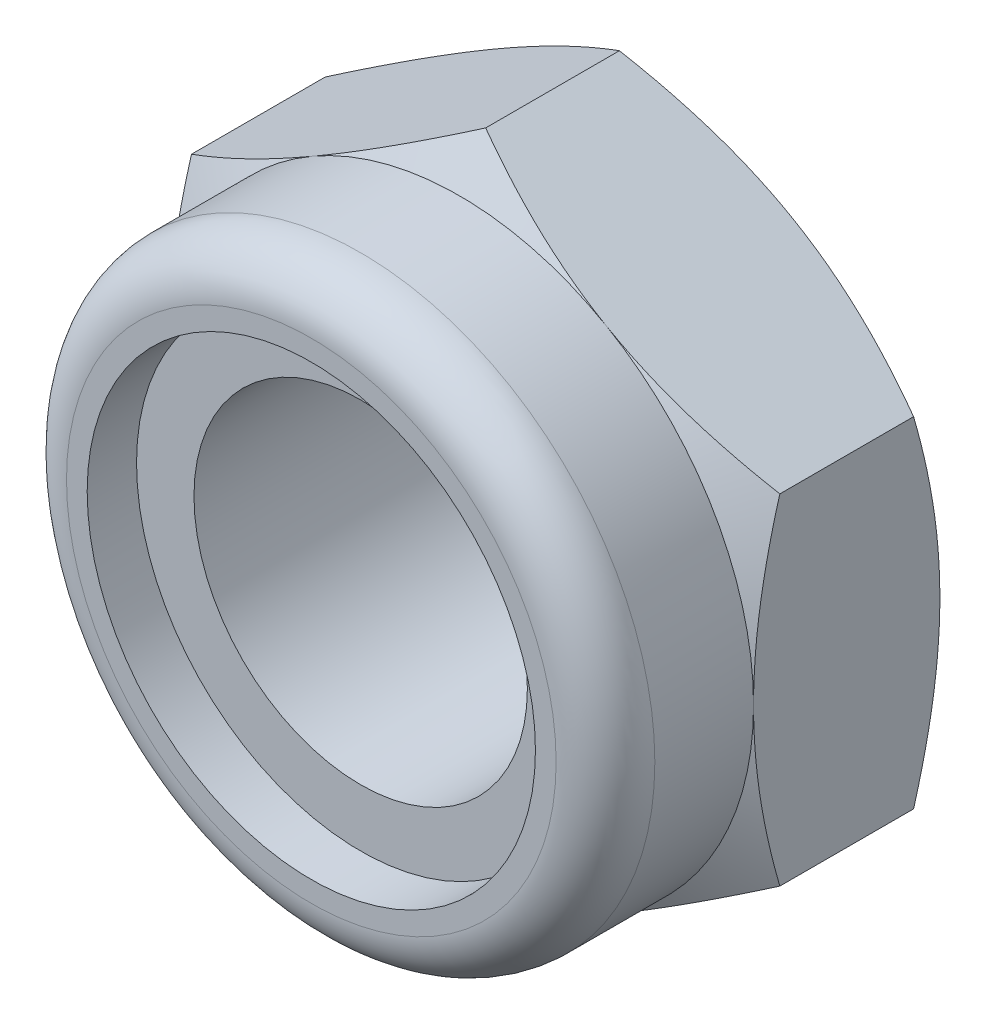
ISO-10303-21;
HEADER;
FILE_DESCRIPTION(('STEP AP214'),'2;1');
FILE_NAME('part.step','',(''),(''),'','','');
FILE_SCHEMA(('AUTOMOTIVE_DESIGN { 1 0 10303 214 1 1 1 1 }'));
ENDSEC;
DATA;
#1=APPLICATION_CONTEXT('core data for automotive mechanical design processes');
#2=APPLICATION_PROTOCOL_DEFINITION('international standard','automotive_design',2000,#1);
#3=PRODUCT_CONTEXT('',#1,'mechanical');
#4=PRODUCT('Part','Part','',(#3));
#5=PRODUCT_RELATED_PRODUCT_CATEGORY('part','',(#4));
#6=PRODUCT_DEFINITION_FORMATION('','',#4);
#7=PRODUCT_DEFINITION_CONTEXT('part definition',#1,'design');
#8=PRODUCT_DEFINITION('design','',#6,#7);
#9=PRODUCT_DEFINITION_SHAPE('','',#8);
#10=(LENGTH_UNIT() NAMED_UNIT(*) SI_UNIT(.MILLI.,.METRE.));
#11=(NAMED_UNIT(*) PLANE_ANGLE_UNIT() SI_UNIT($,.RADIAN.));
#12=(NAMED_UNIT(*) SI_UNIT($,.STERADIAN.) SOLID_ANGLE_UNIT());
#13=UNCERTAINTY_MEASURE_WITH_UNIT(LENGTH_MEASURE(1.E-05),#10,'distance_accuracy_value','');
#14=(GEOMETRIC_REPRESENTATION_CONTEXT(3) GLOBAL_UNCERTAINTY_ASSIGNED_CONTEXT((#13)) GLOBAL_UNIT_ASSIGNED_CONTEXT((#10,
#11,#12)) REPRESENTATION_CONTEXT('',''));
#15=CARTESIAN_POINT('',(0.,0.,0.));
#16=DIRECTION('',(0.,0.,1.));
#17=DIRECTION('',(1.,0.,0.));
#18=AXIS2_PLACEMENT_3D('',#15,#16,#17);
#19=CARTESIAN_POINT('',(0.,0.,-5.7));
#20=DIRECTION('',(0.,0.,1.));
#21=DIRECTION('',(1.,0.,0.));
#22=AXIS2_PLACEMENT_3D('',#19,#20,#21);
#23=CYLINDRICAL_SURFACE('',#22,5.1);
#24=CARTESIAN_POINT('',(0.,0.,3.02));
#25=DIRECTION('',(0.,0.,1.));
#26=DIRECTION('',(1.,0.,0.));
#27=AXIS2_PLACEMENT_3D('',#24,#25,#26);
#28=CIRCLE('',#27,5.1);
#29=CARTESIAN_POINT('',(5.1,0.,3.02));
#30=VERTEX_POINT('',#29);
#31=EDGE_CURVE('E281',#30,#30,#28,.T.);
#32=ORIENTED_EDGE('',*,*,#31,.T.);
#33=EDGE_LOOP('',(#32));
#34=FACE_BOUND('',#33,.T.);
#35=CARTESIAN_POINT('',(0.,0.,-5.04441321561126));
#36=DIRECTION('',(0.,0.,-1.));
#37=DIRECTION('',(-1.,0.,0.));
#38=AXIS2_PLACEMENT_3D('',#35,#36,#37);
#39=CIRCLE('',#38,5.1);
#40=CARTESIAN_POINT('',(-5.1,0.,-5.04441321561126));
#41=VERTEX_POINT('',#40);
#42=EDGE_CURVE('E40',#41,#41,#39,.F.);
#43=ORIENTED_EDGE('',*,*,#42,.F.);
#44=EDGE_LOOP('',(#43));
#45=FACE_BOUND('',#44,.T.);
#46=ADVANCED_FACE('F35',(#34,#45),#23,.F.);
#47=CARTESIAN_POINT('',(0.,10.3923048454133,-5.7));
#48=DIRECTION('',(-0.500000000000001,0.866025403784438,0.));
#49=DIRECTION('',(-0.866025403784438,-0.500000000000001,0.));
#50=AXIS2_PLACEMENT_3D('',#47,#48,#49);
#51=PLANE('',#50);
#52=DIRECTION('',(0.,0.,1.));
#53=VECTOR('',#52,1.);
#54=CARTESIAN_POINT('',(-9.,5.19615242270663,-5.7));
#55=LINE('',#54,#53);
#56=CARTESIAN_POINT('',(-9.,5.19615242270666,-4.89615242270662));
#57=VERTEX_POINT('',#56);
#58=CARTESIAN_POINT('',(-9.,5.19615242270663,-0.803847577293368));
#59=VERTEX_POINT('',#58);
#60=EDGE_CURVE('E254',#57,#59,#55,.T.);
#61=ORIENTED_EDGE('',*,*,#60,.T.);
#62=CARTESIAN_POINT('',(-9.0002,5.19603695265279,-0.803914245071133));
#63=CARTESIAN_POINT('',(-8.80239295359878,5.31024090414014,-0.737982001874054));
#64=CARTESIAN_POINT('',(-8.60381439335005,5.42489028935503,-0.675041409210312));
#65=CARTESIAN_POINT('',(-8.20504463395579,5.65512011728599,-0.555968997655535));
#66=CARTESIAN_POINT('',(-8.00485277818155,5.77070093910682,-0.499840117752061));
#67=CARTESIAN_POINT('',(-7.6024849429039,6.00300811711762,-0.395151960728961));
#68=CARTESIAN_POINT('',(-7.4003054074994,6.11973652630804,-0.346610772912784));
#69=CARTESIAN_POINT('',(-6.99457124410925,6.35398725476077,-0.258148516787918));
#70=CARTESIAN_POINT('',(-6.79101690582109,6.47150940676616,-0.218225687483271));
#71=CARTESIAN_POINT('',(-6.38769409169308,6.70436794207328,-0.148684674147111));
#72=CARTESIAN_POINT('',(-6.187955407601,6.81968712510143,-0.118837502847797));
#73=CARTESIAN_POINT('',(-5.787584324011,7.05084147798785,-0.0687933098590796));
#74=CARTESIAN_POINT('',(-5.58695200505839,7.16667660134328,-0.0485954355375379));
#75=CARTESIAN_POINT('',(-5.18533936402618,7.39854776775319,-0.0183543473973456));
#76=CARTESIAN_POINT('',(-4.98435969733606,7.51458343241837,-0.00829960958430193));
#77=CARTESIAN_POINT('',(-4.58221540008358,7.74676155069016,0.00143766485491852));
#78=CARTESIAN_POINT('',(-4.38105077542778,7.86290400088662,0.00112052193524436));
#79=CARTESIAN_POINT('',(-4.0049673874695,8.08003584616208,-0.00916395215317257));
#80=CARTESIAN_POINT('',(-3.83002210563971,8.18104055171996,-0.0178767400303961));
#81=CARTESIAN_POINT('',(-3.48054132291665,8.38281337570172,-0.0429773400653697));
#82=CARTESIAN_POINT('',(-3.30600585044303,8.48358147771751,-0.0593656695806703));
#83=CARTESIAN_POINT('',(-2.78307512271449,8.7854956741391,-0.119656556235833));
#84=CARTESIAN_POINT('',(-2.43560548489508,8.98610736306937,-0.174677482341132));
#85=CARTESIAN_POINT('',(-1.736980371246,9.3894587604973,-0.312230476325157));
#86=CARTESIAN_POINT('',(-1.38591405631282,9.59214699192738,-0.395345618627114));
#87=CARTESIAN_POINT('',(-0.689016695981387,9.99450087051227,-0.583982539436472));
#88=CARTESIAN_POINT('',(-0.343176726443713,10.1941716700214,-0.689460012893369));
#89=CARTESIAN_POINT('',(0.000200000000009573,10.3924203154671,-0.803914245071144));
#90=B_SPLINE_CURVE_WITH_KNOTS('',3,(#62,#63,#64,#65,#66,#67,#68,#69,#70,#71,#72,#73,#74,#75,#76,
#77,#78,#79,#80,#81,#82,#83,#84,#85,#86,#87,#88,#89),.UNSPECIFIED.,.F.,.F.,(4,2,2,2,2,2,2,2,2,2,
2,2,2,4),(0.,0.71321924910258,1.42674513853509,2.14194697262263,2.85700253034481,
3.55449749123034,4.25193080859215,4.94857085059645,5.64518936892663,6.25162976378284,
6.85811104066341,8.07193747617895,9.31268391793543,10.5509947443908),.UNSPECIFIED.);
#91=CARTESIAN_POINT('',(-4.50000000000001,7.79422863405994,0.));
#92=VERTEX_POINT('',#91);
#93=EDGE_CURVE('E60',#59,#92,#90,.T.);
#94=ORIENTED_EDGE('',*,*,#93,.T.);
#95=CARTESIAN_POINT('',(0.,10.3923048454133,-0.803847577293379));
#96=VERTEX_POINT('',#95);
#97=EDGE_CURVE('E203',#92,#96,#90,.T.);
#98=ORIENTED_EDGE('',*,*,#97,.T.);
#99=DIRECTION('',(0.,0.,1.));
#100=VECTOR('',#99,1.);
#101=CARTESIAN_POINT('',(0.,10.3923048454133,-5.7));
#102=LINE('',#101,#100);
#103=CARTESIAN_POINT('',(0.,10.3923048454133,-4.89615242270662));
#104=VERTEX_POINT('',#103);
#105=EDGE_CURVE('E240',#104,#96,#102,.T.);
#106=ORIENTED_EDGE('',*,*,#105,.F.);
#107=CARTESIAN_POINT('',(-9.0002,5.19603695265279,-4.89608575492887));
#108=CARTESIAN_POINT('',(-8.80239295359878,5.31024090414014,-4.96201799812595));
#109=CARTESIAN_POINT('',(-8.60381439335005,5.42489028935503,-5.02495859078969));
#110=CARTESIAN_POINT('',(-8.20504463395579,5.65512011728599,-5.14403100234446));
#111=CARTESIAN_POINT('',(-8.00485277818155,5.77070093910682,-5.20015988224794));
#112=CARTESIAN_POINT('',(-7.6024849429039,6.00300811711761,-5.30484803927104));
#113=CARTESIAN_POINT('',(-7.4003054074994,6.11973652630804,-5.35338922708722));
#114=CARTESIAN_POINT('',(-6.99457124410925,6.35398725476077,-5.44185148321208));
#115=CARTESIAN_POINT('',(-6.79101690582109,6.47150940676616,-5.48177431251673));
#116=CARTESIAN_POINT('',(-6.38769409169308,6.70436794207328,-5.55131532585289));
#117=CARTESIAN_POINT('',(-6.187955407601,6.81968712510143,-5.5811624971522));
#118=CARTESIAN_POINT('',(-5.787584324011,7.05084147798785,-5.63120669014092));
#119=CARTESIAN_POINT('',(-5.58695200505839,7.16667660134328,-5.65140456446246));
#120=CARTESIAN_POINT('',(-5.18533936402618,7.39854776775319,-5.68164565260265));
#121=CARTESIAN_POINT('',(-4.98435969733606,7.51458343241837,-5.6917003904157));
#122=CARTESIAN_POINT('',(-4.58221540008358,7.74676155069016,-5.70143766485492));
#123=CARTESIAN_POINT('',(-4.38105077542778,7.86290400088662,-5.70112052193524));
#124=CARTESIAN_POINT('',(-4.0049673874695,8.08003584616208,-5.69083604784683));
#125=CARTESIAN_POINT('',(-3.83002210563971,8.18104055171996,-5.6821232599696));
#126=CARTESIAN_POINT('',(-3.48054132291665,8.38281337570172,-5.65702265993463));
#127=CARTESIAN_POINT('',(-3.30600585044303,8.48358147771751,-5.64063433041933));
#128=CARTESIAN_POINT('',(-2.78307512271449,8.7854956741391,-5.58034344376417));
#129=CARTESIAN_POINT('',(-2.43560548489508,8.98610736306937,-5.52532251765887));
#130=CARTESIAN_POINT('',(-1.736980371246,9.3894587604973,-5.38776952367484));
#131=CARTESIAN_POINT('',(-1.38591405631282,9.59214699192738,-5.30465438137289));
#132=CARTESIAN_POINT('',(-0.689016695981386,9.99450087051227,-5.11601746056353));
#133=CARTESIAN_POINT('',(-0.343176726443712,10.1941716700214,-5.01053998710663));
#134=CARTESIAN_POINT('',(0.000200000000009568,10.3924203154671,-4.89608575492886));
#135=B_SPLINE_CURVE_WITH_KNOTS('',3,(#107,#108,#109,#110,#111,#112,#113,#114,#115,#116,#117,
#118,#119,#120,#121,#122,#123,#124,#125,#126,#127,#128,#129,#130,#131,#132,#133,#134),
.UNSPECIFIED.,.F.,.F.,(4,2,2,2,2,2,2,2,2,2,2,2,2,4),(0.,0.713219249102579,1.42674513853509,
2.14194697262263,2.85700253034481,3.55449749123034,4.25193080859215,4.94857085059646,
5.64518936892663,6.25162976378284,6.85811104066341,8.07193747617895,9.31268391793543,
10.5509947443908),.UNSPECIFIED.);
#136=CARTESIAN_POINT('',(-4.50000000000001,7.79422863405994,-5.7));
#137=VERTEX_POINT('',#136);
#138=EDGE_CURVE('E256',#137,#104,#135,.T.);
#139=ORIENTED_EDGE('',*,*,#138,.F.);
#140=EDGE_CURVE('E234',#57,#137,#135,.T.);
#141=ORIENTED_EDGE('',*,*,#140,.F.);
#142=EDGE_LOOP('',(#61,#94,#98,#106,#139,#141));
#143=FACE_BOUND('',#142,.T.);
#144=ADVANCED_FACE('F37',(#143),#51,.T.);
#145=CARTESIAN_POINT('',(9.,5.19615242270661,-5.7));
#146=DIRECTION('',(0.500000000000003,0.866025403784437,0.));
#147=DIRECTION('',(-0.866025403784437,0.500000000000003,0.));
#148=AXIS2_PLACEMENT_3D('',#145,#146,#147);
#149=PLANE('',#148);
#150=ORIENTED_EDGE('',*,*,#105,.T.);
#151=CARTESIAN_POINT('',(-0.000199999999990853,10.3924203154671,-0.803914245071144));
#152=CARTESIAN_POINT('',(0.197607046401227,10.2782163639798,-0.737982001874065));
#153=CARTESIAN_POINT('',(0.396185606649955,10.1635669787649,-0.675041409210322));
#154=CARTESIAN_POINT('',(0.79495536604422,9.93333715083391,-0.555968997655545));
#155=CARTESIAN_POINT('',(0.99514722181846,9.81775632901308,-0.49984011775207));
#156=CARTESIAN_POINT('',(1.39751505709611,9.58544915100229,-0.395151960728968));
#157=CARTESIAN_POINT('',(1.59969459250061,9.46872074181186,-0.34661077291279));
#158=CARTESIAN_POINT('',(2.00542875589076,9.23447001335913,-0.258148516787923));
#159=CARTESIAN_POINT('',(2.20898309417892,9.11694786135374,-0.218225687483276));
#160=CARTESIAN_POINT('',(2.61230590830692,8.88408932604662,-0.148684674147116));
#161=CARTESIAN_POINT('',(2.81204459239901,8.76877014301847,-0.118837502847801));
#162=CARTESIAN_POINT('',(3.212415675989,8.53761579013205,-0.0687933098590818));
#163=CARTESIAN_POINT('',(3.41304799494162,8.42178066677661,-0.0485954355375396));
#164=CARTESIAN_POINT('',(3.81466063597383,8.18990950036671,-0.0183543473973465));
#165=CARTESIAN_POINT('',(4.01564030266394,8.07387383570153,-0.00829960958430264));
#166=CARTESIAN_POINT('',(4.41778459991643,7.84169571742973,0.00143766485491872));
#167=CARTESIAN_POINT('',(4.61894922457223,7.72555326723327,0.00112052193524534));
#168=CARTESIAN_POINT('',(4.99503261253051,7.50842142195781,-0.00916395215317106));
#169=CARTESIAN_POINT('',(5.1699778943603,7.40741671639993,-0.0178767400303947));
#170=CARTESIAN_POINT('',(5.51945867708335,7.20564389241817,-0.0429773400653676));
#171=CARTESIAN_POINT('',(5.69399414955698,7.10487579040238,-0.0593656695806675));
#172=CARTESIAN_POINT('',(6.21692487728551,6.80296159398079,-0.119656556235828));
#173=CARTESIAN_POINT('',(6.56439451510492,6.60234990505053,-0.174677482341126));
#174=CARTESIAN_POINT('',(7.26301962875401,6.19899850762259,-0.312230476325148));
#175=CARTESIAN_POINT('',(7.61408594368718,5.99631027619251,-0.395345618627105));
#176=CARTESIAN_POINT('',(8.31098330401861,5.59395639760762,-0.583982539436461));
#177=CARTESIAN_POINT('',(8.65682327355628,5.39428559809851,-0.689460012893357));
#178=CARTESIAN_POINT('',(9.0002,5.19603695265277,-0.803914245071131));
#179=B_SPLINE_CURVE_WITH_KNOTS('',3,(#151,#152,#153,#154,#155,#156,#157,#158,#159,#160,#161,
#162,#163,#164,#165,#166,#167,#168,#169,#170,#171,#172,#173,#174,#175,#176,#177,#178),
.UNSPECIFIED.,.F.,.F.,(4,2,2,2,2,2,2,2,2,2,2,2,2,4),(0.,0.71321924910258,1.42674513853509,
2.14194697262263,2.85700253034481,3.55449749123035,4.25193080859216,4.94857085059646,
5.64518936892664,6.25162976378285,6.85811104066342,8.07193747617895,9.31268391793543,
10.5509947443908),.UNSPECIFIED.);
#180=CARTESIAN_POINT('',(4.50000000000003,7.79422863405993,0.));
#181=VERTEX_POINT('',#180);
#182=EDGE_CURVE('E212',#96,#181,#179,.T.);
#183=ORIENTED_EDGE('',*,*,#182,.T.);
#184=CARTESIAN_POINT('',(9.,5.19615242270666,-0.803847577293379));
#185=VERTEX_POINT('',#184);
#186=EDGE_CURVE('E204',#181,#185,#179,.T.);
#187=ORIENTED_EDGE('',*,*,#186,.T.);
#188=DIRECTION('',(0.,0.,1.));
#189=VECTOR('',#188,1.);
#190=CARTESIAN_POINT('',(9.,5.19615242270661,-5.7));
#191=LINE('',#190,#189);
#192=CARTESIAN_POINT('',(9.,5.19615242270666,-4.89615242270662));
#193=VERTEX_POINT('',#192);
#194=EDGE_CURVE('E244',#193,#185,#191,.T.);
#195=ORIENTED_EDGE('',*,*,#194,.F.);
#196=CARTESIAN_POINT('',(-0.000199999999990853,10.3924203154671,-4.89608575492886));
#197=CARTESIAN_POINT('',(0.197607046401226,10.2782163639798,-4.96201799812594));
#198=CARTESIAN_POINT('',(0.396185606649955,10.1635669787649,-5.02495859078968));
#199=CARTESIAN_POINT('',(0.79495536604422,9.93333715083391,-5.14403100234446));
#200=CARTESIAN_POINT('',(0.99514722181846,9.81775632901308,-5.20015988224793));
#201=CARTESIAN_POINT('',(1.39751505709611,9.58544915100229,-5.30484803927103));
#202=CARTESIAN_POINT('',(1.59969459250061,9.46872074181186,-5.35338922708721));
#203=CARTESIAN_POINT('',(2.00542875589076,9.23447001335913,-5.44185148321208));
#204=CARTESIAN_POINT('',(2.20898309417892,9.11694786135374,-5.48177431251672));
#205=CARTESIAN_POINT('',(2.61230590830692,8.88408932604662,-5.55131532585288));
#206=CARTESIAN_POINT('',(2.81204459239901,8.76877014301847,-5.5811624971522));
#207=CARTESIAN_POINT('',(3.212415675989,8.53761579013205,-5.63120669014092));
#208=CARTESIAN_POINT('',(3.41304799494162,8.42178066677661,-5.65140456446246));
#209=CARTESIAN_POINT('',(3.81466063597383,8.18990950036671,-5.68164565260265));
#210=CARTESIAN_POINT('',(4.01564030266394,8.07387383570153,-5.6917003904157));
#211=CARTESIAN_POINT('',(4.41778459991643,7.84169571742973,-5.70143766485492));
#212=CARTESIAN_POINT('',(4.61894922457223,7.72555326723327,-5.70112052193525));
#213=CARTESIAN_POINT('',(4.99503261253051,7.50842142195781,-5.69083604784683));
#214=CARTESIAN_POINT('',(5.1699778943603,7.40741671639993,-5.68212325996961));
#215=CARTESIAN_POINT('',(5.51945867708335,7.20564389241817,-5.65702265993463));
#216=CARTESIAN_POINT('',(5.69399414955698,7.10487579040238,-5.64063433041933));
#217=CARTESIAN_POINT('',(6.21692487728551,6.80296159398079,-5.58034344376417));
#218=CARTESIAN_POINT('',(6.56439451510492,6.60234990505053,-5.52532251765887));
#219=CARTESIAN_POINT('',(7.26301962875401,6.19899850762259,-5.38776952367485));
#220=CARTESIAN_POINT('',(7.61408594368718,5.99631027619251,-5.3046543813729));
#221=CARTESIAN_POINT('',(8.31098330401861,5.59395639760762,-5.11601746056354));
#222=CARTESIAN_POINT('',(8.65682327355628,5.39428559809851,-5.01053998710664));
#223=CARTESIAN_POINT('',(9.0002,5.19603695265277,-4.89608575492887));
#224=B_SPLINE_CURVE_WITH_KNOTS('',3,(#196,#197,#198,#199,#200,#201,#202,#203,#204,#205,#206,
#207,#208,#209,#210,#211,#212,#213,#214,#215,#216,#217,#218,#219,#220,#221,#222,#223),
.UNSPECIFIED.,.F.,.F.,(4,2,2,2,2,2,2,2,2,2,2,2,2,4),(0.,0.71321924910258,1.42674513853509,
2.14194697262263,2.85700253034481,3.55449749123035,4.25193080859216,4.94857085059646,
5.64518936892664,6.25162976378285,6.85811104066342,8.07193747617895,9.31268391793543,
10.5509947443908),.UNSPECIFIED.);
#225=CARTESIAN_POINT('',(4.50000000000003,7.79422863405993,-5.7));
#226=VERTEX_POINT('',#225);
#227=EDGE_CURVE('E225',#226,#193,#224,.T.);
#228=ORIENTED_EDGE('',*,*,#227,.F.);
#229=EDGE_CURVE('E232',#104,#226,#224,.T.);
#230=ORIENTED_EDGE('',*,*,#229,.F.);
#231=EDGE_LOOP('',(#150,#183,#187,#195,#228,#230));
#232=FACE_BOUND('',#231,.T.);
#233=ADVANCED_FACE('F215',(#232),#149,.T.);
#234=CARTESIAN_POINT('',(9.,5.19615242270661,-5.7));
#235=DIRECTION('',(-1.,0.,0.));
#236=DIRECTION('',(0.,0.,1.));
#237=AXIS2_PLACEMENT_3D('',#234,#235,#236);
#238=PLANE('',#237);
#239=CARTESIAN_POINT('',(9.,-13.7809619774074,-4.30674034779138));
#240=CARTESIAN_POINT('',(9.,-13.5833938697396,-4.21123885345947));
#241=CARTESIAN_POINT('',(9.,-13.385586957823,-4.11623162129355));
#242=CARTESIAN_POINT('',(9.,-12.9894450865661,-3.92731913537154));
#243=CARTESIAN_POINT('',(9.,-12.7911101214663,-3.8334138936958));
#244=CARTESIAN_POINT('',(9.,-12.1951793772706,-3.55349411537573));
#245=CARTESIAN_POINT('',(9.,-11.796721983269,-3.36930666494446));
#246=CARTESIAN_POINT('',(9.,-10.9947735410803,-3.00593915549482));
#247=CARTESIAN_POINT('',(9.,-10.5912667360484,-2.82679378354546));
#248=CARTESIAN_POINT('',(9.,-9.78093737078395,-2.47619472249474));
#249=CARTESIAN_POINT('',(9.,-9.37411498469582,-2.30474063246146));
#250=CARTESIAN_POINT('',(9.,-8.55145586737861,-1.96953872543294));
#251=CARTESIAN_POINT('',(9.,-8.13556978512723,-1.80591135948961));
#252=CARTESIAN_POINT('',(9.,-7.2988933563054,-1.491471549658));
#253=CARTESIAN_POINT('',(9.,-6.87810247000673,-1.3406605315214));
#254=CARTESIAN_POINT('',(9.,-6.03180598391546,-1.05590655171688));
#255=CARTESIAN_POINT('',(9.,-5.60631258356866,-0.921927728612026));
#256=CARTESIAN_POINT('',(9.,-4.74929212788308,-0.67518705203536));
#257=CARTESIAN_POINT('',(9.,-4.31776702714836,-0.562418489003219));
#258=CARTESIAN_POINT('',(9.,-3.44831631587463,-0.363581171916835));
#259=CARTESIAN_POINT('',(9.,-3.01038903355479,-0.277519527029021));
#260=CARTESIAN_POINT('',(9.,-2.34964451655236,-0.17276642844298));
#261=CARTESIAN_POINT('',(9.,-2.12872697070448,-0.141903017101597));
#262=CARTESIAN_POINT('',(9.,-1.68585612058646,-0.0888965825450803));
#263=CARTESIAN_POINT('',(9.,-1.46390292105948,-0.0667526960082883));
#264=CARTESIAN_POINT('',(9.,-1.02066876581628,-0.0317812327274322));
#265=CARTESIAN_POINT('',(9.,-0.799392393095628,-0.0188958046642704));
#266=CARTESIAN_POINT('',(9.,-0.356492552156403,-0.00250938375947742));
#267=CARTESIAN_POINT('',(9.,-0.134869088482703,0.000991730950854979));
#268=CARTESIAN_POINT('',(9.,0.308263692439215,-0.001473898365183));
#269=CARTESIAN_POINT('',(9.,0.529773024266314,-0.0074379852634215));
#270=CARTESIAN_POINT('',(9.,0.972347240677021,-0.0286857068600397));
#271=CARTESIAN_POINT('',(9.,1.19341210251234,-0.0439698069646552));
#272=CARTESIAN_POINT('',(9.,1.72920526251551,-0.0919895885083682));
#273=CARTESIAN_POINT('',(9.,2.04352190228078,-0.12939492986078));
#274=CARTESIAN_POINT('',(9.,2.66974660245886,-0.220970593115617));
#275=CARTESIAN_POINT('',(9.,2.98165398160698,-0.275145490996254));
#276=CARTESIAN_POINT('',(9.,3.60280284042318,-0.398338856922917));
#277=CARTESIAN_POINT('',(9.,3.91204150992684,-0.467371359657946));
#278=CARTESIAN_POINT('',(9.,4.5273372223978,-0.618173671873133));
#279=CARTESIAN_POINT('',(9.,4.83339456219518,-0.699942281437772));
#280=CARTESIAN_POINT('',(9.,5.44986573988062,-0.876398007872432));
#281=CARTESIAN_POINT('',(9.,5.7602024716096,-0.971352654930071));
#282=CARTESIAN_POINT('',(9.,6.3775956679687,-1.17064401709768));
#283=CARTESIAN_POINT('',(9.,6.68465423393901,-1.27497426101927));
#284=CARTESIAN_POINT('',(9.,7.29425898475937,-1.49086177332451));
#285=CARTESIAN_POINT('',(9.,7.59682084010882,-1.60237505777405));
#286=CARTESIAN_POINT('',(9.,8.19959709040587,-1.83194682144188));
#287=CARTESIAN_POINT('',(9.,8.49981047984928,-1.95000794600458));
#288=CARTESIAN_POINT('',(9.,8.79893322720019,-2.07069526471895));
#289=B_SPLINE_CURVE_WITH_KNOTS('',3,(#239,#240,#241,#242,#243,#244,#245,#246,#247,#248,#249,
#250,#251,#252,#253,#254,#255,#256,#257,#258,#259,#260,#261,#262,#263,#264,#265,#266,#267,#268,
#269,#270,#271,#272,#273,#274,#275,#276,#277,#278,#279,#280,#281,#282,#283,#284,#285,#286,#287,
#288),.UNSPECIFIED.,.F.,.F.,(4,2,2,2,2,2,2,2,2,2,2,2,2,2,2,2,2,2,2,2,2,2,2,2,4),(0.,
0.658317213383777,1.31664163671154,2.63350462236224,3.95790348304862,5.28223322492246,
6.62282162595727,7.96355896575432,9.30138955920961,10.6387962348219,11.9765586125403,
12.6456025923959,13.3145803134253,13.9793407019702,14.644092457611,15.3086576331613,
15.9732559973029,16.9223307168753,17.8716646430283,18.82189928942,19.772044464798,
20.745479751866,21.7182482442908,22.6855413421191,23.6532281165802),.UNSPECIFIED.);
#290=CARTESIAN_POINT('',(9.,-5.19615242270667,-0.803847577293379));
#291=VERTEX_POINT('',#290);
#292=CARTESIAN_POINT('',(9.,0.,0.));
#293=VERTEX_POINT('',#292);
#294=EDGE_CURVE('E191',#291,#293,#289,.T.);
#295=ORIENTED_EDGE('',*,*,#294,.F.);
#296=DIRECTION('',(0.,0.,1.));
#297=VECTOR('',#296,1.);
#298=CARTESIAN_POINT('',(9.,-5.19615242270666,-5.7));
#299=LINE('',#298,#297);
#300=CARTESIAN_POINT('',(9.,-5.19615242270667,-4.89615242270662));
#301=VERTEX_POINT('',#300);
#302=EDGE_CURVE('E247',#301,#291,#299,.T.);
#303=ORIENTED_EDGE('',*,*,#302,.F.);
#304=CARTESIAN_POINT('',(9.,-13.7809619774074,-1.39325965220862));
#305=CARTESIAN_POINT('',(9.,-13.5833938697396,-1.48876114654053));
#306=CARTESIAN_POINT('',(9.,-13.385586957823,-1.58376837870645));
#307=CARTESIAN_POINT('',(9.,-12.9894450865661,-1.77268086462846));
#308=CARTESIAN_POINT('',(9.,-12.7911101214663,-1.86658610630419));
#309=CARTESIAN_POINT('',(9.,-12.1951793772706,-2.14650588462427));
#310=CARTESIAN_POINT('',(9.,-11.796721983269,-2.33069333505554));
#311=CARTESIAN_POINT('',(9.,-10.9947735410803,-2.69406084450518));
#312=CARTESIAN_POINT('',(9.,-10.5912667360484,-2.87320621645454));
#313=CARTESIAN_POINT('',(9.,-9.78093737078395,-3.22380527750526));
#314=CARTESIAN_POINT('',(9.,-9.37411498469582,-3.39525936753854));
#315=CARTESIAN_POINT('',(9.,-8.55145586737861,-3.73046127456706));
#316=CARTESIAN_POINT('',(9.,-8.13556978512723,-3.89408864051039));
#317=CARTESIAN_POINT('',(9.,-7.2988933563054,-4.208528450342));
#318=CARTESIAN_POINT('',(9.,-6.87810247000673,-4.3593394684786));
#319=CARTESIAN_POINT('',(9.,-6.03180598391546,-4.64409344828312));
#320=CARTESIAN_POINT('',(9.,-5.60631258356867,-4.77807227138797));
#321=CARTESIAN_POINT('',(9.,-4.74929212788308,-5.02481294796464));
#322=CARTESIAN_POINT('',(9.,-4.31776702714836,-5.13758151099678));
#323=CARTESIAN_POINT('',(9.,-3.44831631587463,-5.33641882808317));
#324=CARTESIAN_POINT('',(9.,-3.01038903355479,-5.42248047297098));
#325=CARTESIAN_POINT('',(9.,-2.34964451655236,-5.52723357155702));
#326=CARTESIAN_POINT('',(9.,-2.12872697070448,-5.5580969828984));
#327=CARTESIAN_POINT('',(9.,-1.68585612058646,-5.61110341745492));
#328=CARTESIAN_POINT('',(9.,-1.46390292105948,-5.63324730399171));
#329=CARTESIAN_POINT('',(9.,-1.02066876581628,-5.66821876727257));
#330=CARTESIAN_POINT('',(9.,-0.799392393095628,-5.68110419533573));
#331=CARTESIAN_POINT('',(9.,-0.356492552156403,-5.69749061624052));
#332=CARTESIAN_POINT('',(9.,-0.134869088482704,-5.70099173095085));
#333=CARTESIAN_POINT('',(9.,0.308263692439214,-5.69852610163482));
#334=CARTESIAN_POINT('',(9.,0.529773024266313,-5.69256201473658));
#335=CARTESIAN_POINT('',(9.,0.97234724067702,-5.67131429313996));
#336=CARTESIAN_POINT('',(9.,1.19341210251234,-5.65603019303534));
#337=CARTESIAN_POINT('',(9.,1.72920526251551,-5.60801041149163));
#338=CARTESIAN_POINT('',(9.,2.04352190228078,-5.57060507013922));
#339=CARTESIAN_POINT('',(9.,2.66974660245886,-5.47902940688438));
#340=CARTESIAN_POINT('',(9.,2.98165398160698,-5.42485450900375));
#341=CARTESIAN_POINT('',(9.,3.60280284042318,-5.30166114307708));
#342=CARTESIAN_POINT('',(9.,3.91204150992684,-5.23262864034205));
#343=CARTESIAN_POINT('',(9.,4.5273372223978,-5.08182632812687));
#344=CARTESIAN_POINT('',(9.,4.83339456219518,-5.00005771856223));
#345=CARTESIAN_POINT('',(9.,5.44986573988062,-4.82360199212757));
#346=CARTESIAN_POINT('',(9.,5.7602024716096,-4.72864734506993));
#347=CARTESIAN_POINT('',(9.,6.3775956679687,-4.52935598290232));
#348=CARTESIAN_POINT('',(9.,6.68465423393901,-4.42502573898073));
#349=CARTESIAN_POINT('',(9.,7.29425898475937,-4.20913822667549));
#350=CARTESIAN_POINT('',(9.,7.59682084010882,-4.09762494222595));
#351=CARTESIAN_POINT('',(9.,8.19959709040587,-3.86805317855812));
#352=CARTESIAN_POINT('',(9.,8.49981047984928,-3.74999205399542));
#353=CARTESIAN_POINT('',(9.,8.79893322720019,-3.62930473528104));
#354=B_SPLINE_CURVE_WITH_KNOTS('',3,(#304,#305,#306,#307,#308,#309,#310,#311,#312,#313,#314,
#315,#316,#317,#318,#319,#320,#321,#322,#323,#324,#325,#326,#327,#328,#329,#330,#331,#332,#333,
#334,#335,#336,#337,#338,#339,#340,#341,#342,#343,#344,#345,#346,#347,#348,#349,#350,#351,#352,
#353),.UNSPECIFIED.,.F.,.F.,(4,2,2,2,2,2,2,2,2,2,2,2,2,2,2,2,2,2,2,2,2,2,2,2,4),(0.,
0.658317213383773,1.31664163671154,2.63350462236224,3.95790348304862,5.28223322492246,
6.62282162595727,7.96355896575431,9.3013895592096,10.6387962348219,11.9765586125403,
12.6456025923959,13.3145803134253,13.9793407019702,14.644092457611,15.3086576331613,
15.9732559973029,16.9223307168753,17.8716646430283,18.82189928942,19.772044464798,
20.745479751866,21.7182482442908,22.6855413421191,23.6532281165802),.UNSPECIFIED.);
#355=CARTESIAN_POINT('',(9.,0.,-5.7));
#356=VERTEX_POINT('',#355);
#357=EDGE_CURVE('E372',#301,#356,#354,.T.);
#358=ORIENTED_EDGE('',*,*,#357,.T.);
#359=EDGE_CURVE('E233',#356,#193,#354,.T.);
#360=ORIENTED_EDGE('',*,*,#359,.T.);
#361=ORIENTED_EDGE('',*,*,#194,.T.);
#362=EDGE_CURVE('E202',#293,#185,#289,.T.);
#363=ORIENTED_EDGE('',*,*,#362,.F.);
#364=EDGE_LOOP('',(#295,#303,#358,#360,#361,#363));
#365=FACE_BOUND('',#364,.T.);
#366=ADVANCED_FACE('F219',(#365),#238,.F.);
#367=CARTESIAN_POINT('',(0.,-10.3923048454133,-5.7));
#368=DIRECTION('',(0.500000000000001,-0.866025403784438,0.));
#369=DIRECTION('',(0.866025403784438,0.500000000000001,0.));
#370=AXIS2_PLACEMENT_3D('',#367,#368,#369);
#371=PLANE('',#370);
#372=ORIENTED_EDGE('',*,*,#302,.T.);
#373=CARTESIAN_POINT('',(9.0002,-5.19603695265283,-0.803914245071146));
#374=CARTESIAN_POINT('',(8.80239295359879,-5.31024090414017,-0.737982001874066));
#375=CARTESIAN_POINT('',(8.60381439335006,-5.42489028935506,-0.675041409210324));
#376=CARTESIAN_POINT('',(8.20504463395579,-5.65512011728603,-0.555968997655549));
#377=CARTESIAN_POINT('',(8.00485277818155,-5.77070093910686,-0.499840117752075));
#378=CARTESIAN_POINT('',(7.6024849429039,-6.00300811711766,-0.395151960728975));
#379=CARTESIAN_POINT('',(7.4003054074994,-6.11973652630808,-0.346610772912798));
#380=CARTESIAN_POINT('',(6.99457124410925,-6.35398725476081,-0.258148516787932));
#381=CARTESIAN_POINT('',(6.79101690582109,-6.4715094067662,-0.218225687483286));
#382=CARTESIAN_POINT('',(6.38769409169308,-6.70436794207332,-0.148684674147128));
#383=CARTESIAN_POINT('',(6.18795540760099,-6.81968712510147,-0.118837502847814));
#384=CARTESIAN_POINT('',(5.787584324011,-7.05084147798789,-0.068793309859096));
#385=CARTESIAN_POINT('',(5.58695200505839,-7.16667660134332,-0.048595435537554));
#386=CARTESIAN_POINT('',(5.18533936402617,-7.39854776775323,-0.0183543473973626));
#387=CARTESIAN_POINT('',(4.98435969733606,-7.51458343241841,-0.00829960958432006));
#388=CARTESIAN_POINT('',(4.58221540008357,-7.74676155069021,0.00143766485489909));
#389=CARTESIAN_POINT('',(4.38105077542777,-7.86290400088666,0.00112052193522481));
#390=CARTESIAN_POINT('',(4.00496738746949,-8.08003584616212,-0.00916395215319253));
#391=CARTESIAN_POINT('',(3.8300221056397,-8.18104055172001,-0.0178767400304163));
#392=CARTESIAN_POINT('',(3.48054132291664,-8.38281337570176,-0.0429773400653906));
#393=CARTESIAN_POINT('',(3.30600585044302,-8.48358147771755,-0.0593656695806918));
#394=CARTESIAN_POINT('',(2.78307512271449,-8.78549567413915,-0.119656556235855));
#395=CARTESIAN_POINT('',(2.43560548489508,-8.9861073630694,-0.174677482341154));
#396=CARTESIAN_POINT('',(1.73698037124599,-9.38945876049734,-0.312230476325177));
#397=CARTESIAN_POINT('',(1.38591405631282,-9.59214699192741,-0.395345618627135));
#398=CARTESIAN_POINT('',(0.689016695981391,-9.9945008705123,-0.583982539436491));
#399=CARTESIAN_POINT('',(0.343176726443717,-10.1941716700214,-0.689460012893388));
#400=CARTESIAN_POINT('',(-0.000200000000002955,-10.3924203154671,-0.803914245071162));
#401=B_SPLINE_CURVE_WITH_KNOTS('',3,(#373,#374,#375,#376,#377,#378,#379,#380,#381,#382,#383,
#384,#385,#386,#387,#388,#389,#390,#391,#392,#393,#394,#395,#396,#397,#398,#399,#400),
.UNSPECIFIED.,.F.,.F.,(4,2,2,2,2,2,2,2,2,2,2,2,2,4),(0.,0.713219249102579,1.42674513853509,
2.14194697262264,2.85700253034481,3.55449749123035,4.25193080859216,4.94857085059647,
5.64518936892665,6.25162976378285,6.85811104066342,8.07193747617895,9.31268391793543,
10.5509947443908),.UNSPECIFIED.);
#402=CARTESIAN_POINT('',(4.50000000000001,-7.79422863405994,0.));
#403=VERTEX_POINT('',#402);
#404=EDGE_CURVE('E366',#291,#403,#401,.T.);
#405=ORIENTED_EDGE('',*,*,#404,.T.);
#406=CARTESIAN_POINT('',(0.,-10.3923048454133,-0.803847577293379));
#407=VERTEX_POINT('',#406);
#408=EDGE_CURVE('E184',#403,#407,#401,.T.);
#409=ORIENTED_EDGE('',*,*,#408,.T.);
#410=DIRECTION('',(0.,0.,1.));
#411=VECTOR('',#410,1.);
#412=CARTESIAN_POINT('',(0.,-10.3923048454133,-5.7));
#413=LINE('',#412,#411);
#414=CARTESIAN_POINT('',(0.,-10.3923048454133,-4.89615242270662));
#415=VERTEX_POINT('',#414);
#416=EDGE_CURVE('E250',#415,#407,#413,.T.);
#417=ORIENTED_EDGE('',*,*,#416,.F.);
#418=CARTESIAN_POINT('',(9.0002,-5.19603695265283,-4.89608575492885));
#419=CARTESIAN_POINT('',(8.80239295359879,-5.31024090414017,-4.96201799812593));
#420=CARTESIAN_POINT('',(8.60381439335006,-5.42489028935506,-5.02495859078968));
#421=CARTESIAN_POINT('',(8.20504463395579,-5.65512011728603,-5.14403100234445));
#422=CARTESIAN_POINT('',(8.00485277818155,-5.77070093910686,-5.20015988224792));
#423=CARTESIAN_POINT('',(7.6024849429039,-6.00300811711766,-5.30484803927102));
#424=CARTESIAN_POINT('',(7.4003054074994,-6.11973652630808,-5.3533892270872));
#425=CARTESIAN_POINT('',(6.99457124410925,-6.35398725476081,-5.44185148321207));
#426=CARTESIAN_POINT('',(6.79101690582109,-6.4715094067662,-5.48177431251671));
#427=CARTESIAN_POINT('',(6.38769409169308,-6.70436794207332,-5.55131532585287));
#428=CARTESIAN_POINT('',(6.18795540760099,-6.81968712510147,-5.58116249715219));
#429=CARTESIAN_POINT('',(5.787584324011,-7.05084147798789,-5.6312066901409));
#430=CARTESIAN_POINT('',(5.58695200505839,-7.16667660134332,-5.65140456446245));
#431=CARTESIAN_POINT('',(5.18533936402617,-7.39854776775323,-5.68164565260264));
#432=CARTESIAN_POINT('',(4.98435969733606,-7.51458343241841,-5.69170039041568));
#433=CARTESIAN_POINT('',(4.58221540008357,-7.74676155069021,-5.7014376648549));
#434=CARTESIAN_POINT('',(4.38105077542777,-7.86290400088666,-5.70112052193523));
#435=CARTESIAN_POINT('',(4.00496738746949,-8.08003584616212,-5.69083604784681));
#436=CARTESIAN_POINT('',(3.8300221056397,-8.18104055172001,-5.68212325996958));
#437=CARTESIAN_POINT('',(3.48054132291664,-8.38281337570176,-5.65702265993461));
#438=CARTESIAN_POINT('',(3.30600585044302,-8.48358147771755,-5.64063433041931));
#439=CARTESIAN_POINT('',(2.78307512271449,-8.78549567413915,-5.58034344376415));
#440=CARTESIAN_POINT('',(2.43560548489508,-8.9861073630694,-5.52532251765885));
#441=CARTESIAN_POINT('',(1.73698037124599,-9.38945876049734,-5.38776952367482));
#442=CARTESIAN_POINT('',(1.38591405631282,-9.59214699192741,-5.30465438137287));
#443=CARTESIAN_POINT('',(0.689016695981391,-9.9945008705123,-5.11601746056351));
#444=CARTESIAN_POINT('',(0.343176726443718,-10.1941716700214,-5.01053998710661));
#445=CARTESIAN_POINT('',(-0.000200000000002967,-10.3924203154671,-4.89608575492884));
#446=B_SPLINE_CURVE_WITH_KNOTS('',3,(#418,#419,#420,#421,#422,#423,#424,#425,#426,#427,#428,
#429,#430,#431,#432,#433,#434,#435,#436,#437,#438,#439,#440,#441,#442,#443,#444,#445),
.UNSPECIFIED.,.F.,.F.,(4,2,2,2,2,2,2,2,2,2,2,2,2,4),(0.,0.713219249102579,1.42674513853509,
2.14194697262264,2.85700253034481,3.55449749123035,4.25193080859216,4.94857085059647,
5.64518936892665,6.25162976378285,6.85811104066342,8.07193747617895,9.31268391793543,
10.5509947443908),.UNSPECIFIED.);
#447=CARTESIAN_POINT('',(4.50000000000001,-7.79422863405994,-5.7));
#448=VERTEX_POINT('',#447);
#449=EDGE_CURVE('E343',#448,#415,#446,.T.);
#450=ORIENTED_EDGE('',*,*,#449,.F.);
#451=EDGE_CURVE('E368',#301,#448,#446,.T.);
#452=ORIENTED_EDGE('',*,*,#451,.F.);
#453=EDGE_LOOP('',(#372,#405,#409,#417,#450,#452));
#454=FACE_BOUND('',#453,.T.);
#455=ADVANCED_FACE('F351',(#454),#371,.T.);
#456=CARTESIAN_POINT('',(-9.,-5.19615242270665,-5.7));
#457=DIRECTION('',(-0.500000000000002,-0.866025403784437,0.));
#458=DIRECTION('',(0.866025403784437,-0.500000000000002,0.));
#459=AXIS2_PLACEMENT_3D('',#456,#457,#458);
#460=PLANE('',#459);
#461=ORIENTED_EDGE('',*,*,#416,.T.);
#462=CARTESIAN_POINT('',(0.000199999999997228,-10.3924203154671,-0.803914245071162));
#463=CARTESIAN_POINT('',(-0.19760704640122,-10.2782163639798,-0.737982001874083));
#464=CARTESIAN_POINT('',(-0.396185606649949,-10.1635669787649,-0.67504140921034));
#465=CARTESIAN_POINT('',(-0.794955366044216,-9.93333715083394,-0.555968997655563));
#466=CARTESIAN_POINT('',(-0.995147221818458,-9.81775632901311,-0.499840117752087));
#467=CARTESIAN_POINT('',(-1.39751505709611,-9.58544915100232,-0.395151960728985));
#468=CARTESIAN_POINT('',(-1.59969459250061,-9.46872074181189,-0.346610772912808));
#469=CARTESIAN_POINT('',(-2.00542875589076,-9.23447001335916,-0.25814851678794));
#470=CARTESIAN_POINT('',(-2.20898309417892,-9.11694786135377,-0.218225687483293));
#471=CARTESIAN_POINT('',(-2.61230590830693,-8.88408932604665,-0.148684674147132));
#472=CARTESIAN_POINT('',(-2.81204459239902,-8.7687701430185,-0.118837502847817));
#473=CARTESIAN_POINT('',(-3.21241567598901,-8.53761579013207,-0.0687933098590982));
#474=CARTESIAN_POINT('',(-3.41304799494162,-8.42178066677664,-0.0485954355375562));
#475=CARTESIAN_POINT('',(-3.81466063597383,-8.18990950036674,-0.0183543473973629));
#476=CARTESIAN_POINT('',(-4.01564030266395,-8.07387383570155,-0.00829960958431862));
#477=CARTESIAN_POINT('',(-4.41778459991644,-7.84169571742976,0.00143766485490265));
#478=CARTESIAN_POINT('',(-4.61894922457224,-7.7255532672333,0.00112052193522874));
#479=CARTESIAN_POINT('',(-4.99503261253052,-7.50842142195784,-0.00916395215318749));
#480=CARTESIAN_POINT('',(-5.16997789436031,-7.40741671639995,-0.0178767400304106));
#481=CARTESIAN_POINT('',(-5.51945867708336,-7.2056438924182,-0.042977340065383));
#482=CARTESIAN_POINT('',(-5.69399414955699,-7.10487579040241,-0.059365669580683));
#483=CARTESIAN_POINT('',(-6.21692487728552,-6.80296159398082,-0.119656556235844));
#484=CARTESIAN_POINT('',(-6.56439451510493,-6.60234990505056,-0.174677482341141));
#485=CARTESIAN_POINT('',(-7.26301962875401,-6.19899850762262,-0.312230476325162));
#486=CARTESIAN_POINT('',(-7.61408594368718,-5.99631027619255,-0.395345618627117));
#487=CARTESIAN_POINT('',(-8.31098330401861,-5.59395639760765,-0.583982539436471));
#488=CARTESIAN_POINT('',(-8.65682327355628,-5.39428559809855,-0.689460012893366));
#489=CARTESIAN_POINT('',(-9.0002,-5.19603695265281,-0.803914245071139));
#490=B_SPLINE_CURVE_WITH_KNOTS('',3,(#462,#463,#464,#465,#466,#467,#468,#469,#470,#471,#472,
#473,#474,#475,#476,#477,#478,#479,#480,#481,#482,#483,#484,#485,#486,#487,#488,#489),
.UNSPECIFIED.,.F.,.F.,(4,2,2,2,2,2,2,2,2,2,2,2,2,4),(0.,0.713219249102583,1.4267451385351,
2.14194697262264,2.85700253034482,3.55449749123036,4.25193080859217,4.94857085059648,
5.64518936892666,6.25162976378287,6.85811104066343,8.07193747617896,9.31268391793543,
10.5509947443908),.UNSPECIFIED.);
#491=CARTESIAN_POINT('',(-4.50000000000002,-7.79422863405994,0.));
#492=VERTEX_POINT('',#491);
#493=EDGE_CURVE('E151',#407,#492,#490,.T.);
#494=ORIENTED_EDGE('',*,*,#493,.T.);
#495=CARTESIAN_POINT('',(-9.,-5.19615242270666,-0.803847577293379));
#496=VERTEX_POINT('',#495);
#497=EDGE_CURVE('E142',#492,#496,#490,.T.);
#498=ORIENTED_EDGE('',*,*,#497,.T.);
#499=DIRECTION('',(0.,0.,1.));
#500=VECTOR('',#499,1.);
#501=CARTESIAN_POINT('',(-9.,-5.19615242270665,-5.7));
#502=LINE('',#501,#500);
#503=CARTESIAN_POINT('',(-9.,-5.19615242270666,-4.89615242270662));
#504=VERTEX_POINT('',#503);
#505=EDGE_CURVE('E150',#504,#496,#502,.T.);
#506=ORIENTED_EDGE('',*,*,#505,.F.);
#507=CARTESIAN_POINT('',(0.000199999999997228,-10.3924203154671,-4.89608575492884));
#508=CARTESIAN_POINT('',(-0.19760704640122,-10.2782163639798,-4.96201799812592));
#509=CARTESIAN_POINT('',(-0.396185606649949,-10.1635669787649,-5.02495859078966));
#510=CARTESIAN_POINT('',(-0.794955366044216,-9.93333715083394,-5.14403100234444));
#511=CARTESIAN_POINT('',(-0.995147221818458,-9.81775632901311,-5.20015988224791));
#512=CARTESIAN_POINT('',(-1.39751505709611,-9.58544915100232,-5.30484803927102));
#513=CARTESIAN_POINT('',(-1.59969459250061,-9.46872074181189,-5.35338922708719));
#514=CARTESIAN_POINT('',(-2.00542875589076,-9.23447001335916,-5.44185148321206));
#515=CARTESIAN_POINT('',(-2.20898309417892,-9.11694786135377,-5.48177431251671));
#516=CARTESIAN_POINT('',(-2.61230590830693,-8.88408932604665,-5.55131532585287));
#517=CARTESIAN_POINT('',(-2.81204459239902,-8.7687701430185,-5.58116249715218));
#518=CARTESIAN_POINT('',(-3.21241567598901,-8.53761579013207,-5.6312066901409));
#519=CARTESIAN_POINT('',(-3.41304799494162,-8.42178066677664,-5.65140456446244));
#520=CARTESIAN_POINT('',(-3.81466063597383,-8.18990950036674,-5.68164565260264));
#521=CARTESIAN_POINT('',(-4.01564030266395,-8.07387383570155,-5.69170039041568));
#522=CARTESIAN_POINT('',(-4.41778459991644,-7.84169571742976,-5.7014376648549));
#523=CARTESIAN_POINT('',(-4.61894922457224,-7.7255532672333,-5.70112052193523));
#524=CARTESIAN_POINT('',(-4.99503261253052,-7.50842142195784,-5.69083604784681));
#525=CARTESIAN_POINT('',(-5.16997789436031,-7.40741671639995,-5.68212325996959));
#526=CARTESIAN_POINT('',(-5.51945867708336,-7.2056438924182,-5.65702265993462));
#527=CARTESIAN_POINT('',(-5.69399414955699,-7.10487579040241,-5.64063433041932));
#528=CARTESIAN_POINT('',(-6.21692487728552,-6.80296159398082,-5.58034344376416));
#529=CARTESIAN_POINT('',(-6.56439451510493,-6.60234990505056,-5.52532251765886));
#530=CARTESIAN_POINT('',(-7.26301962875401,-6.19899850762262,-5.38776952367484));
#531=CARTESIAN_POINT('',(-7.61408594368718,-5.99631027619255,-5.30465438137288));
#532=CARTESIAN_POINT('',(-8.31098330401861,-5.59395639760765,-5.11601746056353));
#533=CARTESIAN_POINT('',(-8.65682327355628,-5.39428559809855,-5.01053998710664));
#534=CARTESIAN_POINT('',(-9.0002,-5.19603695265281,-4.89608575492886));
#535=B_SPLINE_CURVE_WITH_KNOTS('',3,(#507,#508,#509,#510,#511,#512,#513,#514,#515,#516,#517,
#518,#519,#520,#521,#522,#523,#524,#525,#526,#527,#528,#529,#530,#531,#532,#533,#534),
.UNSPECIFIED.,.F.,.F.,(4,2,2,2,2,2,2,2,2,2,2,2,2,4),(0.,0.713219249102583,1.4267451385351,
2.14194697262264,2.85700253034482,3.55449749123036,4.25193080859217,4.94857085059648,
5.64518936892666,6.25162976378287,6.85811104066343,8.07193747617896,9.31268391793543,
10.5509947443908),.UNSPECIFIED.);
#536=CARTESIAN_POINT('',(-4.50000000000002,-7.79422863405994,-5.7));
#537=VERTEX_POINT('',#536);
#538=EDGE_CURVE('E330',#537,#504,#535,.T.);
#539=ORIENTED_EDGE('',*,*,#538,.F.);
#540=EDGE_CURVE('E342',#415,#537,#535,.T.);
#541=ORIENTED_EDGE('',*,*,#540,.F.);
#542=EDGE_LOOP('',(#461,#494,#498,#506,#539,#541));
#543=FACE_BOUND('',#542,.T.);
#544=ADVANCED_FACE('F348',(#543),#460,.T.);
#545=CARTESIAN_POINT('',(-9.,5.19615242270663,-5.7));
#546=DIRECTION('',(-1.,0.,0.));
#547=DIRECTION('',(0.,0.,1.));
#548=AXIS2_PLACEMENT_3D('',#545,#546,#547);
#549=PLANE('',#548);
#550=ORIENTED_EDGE('',*,*,#505,.T.);
#551=CARTESIAN_POINT('',(-9.,-13.7809619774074,-4.30674034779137));
#552=CARTESIAN_POINT('',(-9.,-13.5833938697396,-4.21123885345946));
#553=CARTESIAN_POINT('',(-9.,-13.385586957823,-4.11623162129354));
#554=CARTESIAN_POINT('',(-9.,-12.9894450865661,-3.92731913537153));
#555=CARTESIAN_POINT('',(-9.,-12.7911101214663,-3.83341389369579));
#556=CARTESIAN_POINT('',(-9.,-12.1951793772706,-3.55349411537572));
#557=CARTESIAN_POINT('',(-9.,-11.796721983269,-3.36930666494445));
#558=CARTESIAN_POINT('',(-9.,-10.9947735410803,-3.00593915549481));
#559=CARTESIAN_POINT('',(-9.,-10.5912667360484,-2.82679378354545));
#560=CARTESIAN_POINT('',(-9.,-9.78093737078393,-2.47619472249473));
#561=CARTESIAN_POINT('',(-9.,-9.3741149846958,-2.30474063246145));
#562=CARTESIAN_POINT('',(-9.,-8.55145586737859,-1.96953872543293));
#563=CARTESIAN_POINT('',(-9.,-8.13556978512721,-1.80591135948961));
#564=CARTESIAN_POINT('',(-9.,-7.29889335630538,-1.491471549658));
#565=CARTESIAN_POINT('',(-9.,-6.87810247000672,-1.3406605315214));
#566=CARTESIAN_POINT('',(-9.,-6.03180598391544,-1.05590655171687));
#567=CARTESIAN_POINT('',(-9.,-5.60631258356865,-0.92192772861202));
#568=CARTESIAN_POINT('',(-9.,-4.74929212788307,-0.675187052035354));
#569=CARTESIAN_POINT('',(-9.,-4.31776702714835,-0.562418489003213));
#570=CARTESIAN_POINT('',(-9.,-3.44831631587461,-0.36358117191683));
#571=CARTESIAN_POINT('',(-9.,-3.01038903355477,-0.277519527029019));
#572=CARTESIAN_POINT('',(-9.,-2.34964451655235,-0.172766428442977));
#573=CARTESIAN_POINT('',(-9.,-2.12872697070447,-0.141903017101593));
#574=CARTESIAN_POINT('',(-9.,-1.68585612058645,-0.0888965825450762));
#575=CARTESIAN_POINT('',(-9.,-1.46390292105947,-0.0667526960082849));
#576=CARTESIAN_POINT('',(-9.,-1.02066876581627,-0.0317812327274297));
#577=CARTESIAN_POINT('',(-9.,-0.799392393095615,-0.0188958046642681));
#578=CARTESIAN_POINT('',(-9.,-0.356492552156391,-0.00250938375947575));
#579=CARTESIAN_POINT('',(-9.,-0.134869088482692,0.000991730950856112));
#580=CARTESIAN_POINT('',(-9.,0.308263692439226,-0.00147389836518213));
#581=CARTESIAN_POINT('',(-9.,0.529773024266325,-0.00743798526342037));
#582=CARTESIAN_POINT('',(-9.,0.972347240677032,-0.0286857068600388));
#583=CARTESIAN_POINT('',(-9.,1.19341210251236,-0.043969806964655));
#584=CARTESIAN_POINT('',(-9.,1.72920526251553,-0.0919895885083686));
#585=CARTESIAN_POINT('',(-9.,2.04352190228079,-0.12939492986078));
#586=CARTESIAN_POINT('',(-9.,2.66974660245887,-0.220970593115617));
#587=CARTESIAN_POINT('',(-9.,2.981653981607,-0.275145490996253));
#588=CARTESIAN_POINT('',(-9.,3.60280284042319,-0.398338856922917));
#589=CARTESIAN_POINT('',(-9.,3.91204150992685,-0.467371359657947));
#590=CARTESIAN_POINT('',(-9.,4.52733722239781,-0.618173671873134));
#591=CARTESIAN_POINT('',(-9.,4.83339456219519,-0.699942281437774));
#592=CARTESIAN_POINT('',(-9.,5.44986573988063,-0.876398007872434));
#593=CARTESIAN_POINT('',(-9.,5.76020247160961,-0.971352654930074));
#594=CARTESIAN_POINT('',(-9.,6.37759566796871,-1.17064401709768));
#595=CARTESIAN_POINT('',(-9.,6.68465423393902,-1.27497426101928));
#596=CARTESIAN_POINT('',(-9.,7.29425898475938,-1.49086177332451));
#597=CARTESIAN_POINT('',(-9.,7.59682084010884,-1.60237505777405));
#598=CARTESIAN_POINT('',(-9.,8.19959709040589,-1.83194682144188));
#599=CARTESIAN_POINT('',(-9.,8.49981047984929,-1.95000794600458));
#600=CARTESIAN_POINT('',(-9.,8.79893322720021,-2.07069526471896));
#601=B_SPLINE_CURVE_WITH_KNOTS('',3,(#551,#552,#553,#554,#555,#556,#557,#558,#559,#560,#561,
#562,#563,#564,#565,#566,#567,#568,#569,#570,#571,#572,#573,#574,#575,#576,#577,#578,#579,#580,
#581,#582,#583,#584,#585,#586,#587,#588,#589,#590,#591,#592,#593,#594,#595,#596,#597,#598,#599,
#600),.UNSPECIFIED.,.F.,.F.,(4,2,2,2,2,2,2,2,2,2,2,2,2,2,2,2,2,2,2,2,2,2,2,2,4),(0.,
0.658317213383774,1.31664163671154,2.63350462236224,3.95790348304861,5.28223322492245,
6.62282162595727,7.96355896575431,9.3013895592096,10.6387962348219,11.9765586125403,
12.6456025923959,13.3145803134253,13.9793407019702,14.644092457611,15.3086576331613,
15.9732559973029,16.9223307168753,17.8716646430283,18.82189928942,19.7720444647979,
20.745479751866,21.7182482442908,22.6855413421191,23.6532281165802),.UNSPECIFIED.);
#602=CARTESIAN_POINT('',(-9.,0.,0.));
#603=VERTEX_POINT('',#602);
#604=EDGE_CURVE('E135',#496,#603,#601,.T.);
#605=ORIENTED_EDGE('',*,*,#604,.T.);
#606=EDGE_CURVE('E129',#603,#59,#601,.T.);
#607=ORIENTED_EDGE('',*,*,#606,.T.);
#608=ORIENTED_EDGE('',*,*,#60,.F.);
#609=CARTESIAN_POINT('',(-9.,-13.7809619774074,-1.39325965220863));
#610=CARTESIAN_POINT('',(-9.,-13.5833938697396,-1.48876114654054));
#611=CARTESIAN_POINT('',(-9.,-13.385586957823,-1.58376837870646));
#612=CARTESIAN_POINT('',(-9.,-12.9894450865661,-1.77268086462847));
#613=CARTESIAN_POINT('',(-9.,-12.7911101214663,-1.86658610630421));
#614=CARTESIAN_POINT('',(-9.,-12.1951793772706,-2.14650588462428));
#615=CARTESIAN_POINT('',(-9.,-11.796721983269,-2.33069333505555));
#616=CARTESIAN_POINT('',(-9.,-10.9947735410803,-2.69406084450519));
#617=CARTESIAN_POINT('',(-9.,-10.5912667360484,-2.87320621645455));
#618=CARTESIAN_POINT('',(-9.,-9.78093737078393,-3.22380527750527));
#619=CARTESIAN_POINT('',(-9.,-9.3741149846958,-3.39525936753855));
#620=CARTESIAN_POINT('',(-9.,-8.55145586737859,-3.73046127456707));
#621=CARTESIAN_POINT('',(-9.,-8.13556978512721,-3.89408864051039));
#622=CARTESIAN_POINT('',(-9.,-7.29889335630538,-4.208528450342));
#623=CARTESIAN_POINT('',(-9.,-6.87810247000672,-4.3593394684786));
#624=CARTESIAN_POINT('',(-9.,-6.03180598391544,-4.64409344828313));
#625=CARTESIAN_POINT('',(-9.,-5.60631258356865,-4.77807227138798));
#626=CARTESIAN_POINT('',(-9.,-4.74929212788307,-5.02481294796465));
#627=CARTESIAN_POINT('',(-9.,-4.31776702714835,-5.13758151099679));
#628=CARTESIAN_POINT('',(-9.,-3.44831631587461,-5.33641882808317));
#629=CARTESIAN_POINT('',(-9.,-3.01038903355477,-5.42248047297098));
#630=CARTESIAN_POINT('',(-9.,-2.34964451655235,-5.52723357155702));
#631=CARTESIAN_POINT('',(-9.,-2.12872697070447,-5.55809698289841));
#632=CARTESIAN_POINT('',(-9.,-1.68585612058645,-5.61110341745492));
#633=CARTESIAN_POINT('',(-9.,-1.46390292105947,-5.63324730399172));
#634=CARTESIAN_POINT('',(-9.,-1.02066876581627,-5.66821876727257));
#635=CARTESIAN_POINT('',(-9.,-0.799392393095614,-5.68110419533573));
#636=CARTESIAN_POINT('',(-9.,-0.35649255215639,-5.69749061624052));
#637=CARTESIAN_POINT('',(-9.,-0.134869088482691,-5.70099173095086));
#638=CARTESIAN_POINT('',(-9.,0.308263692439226,-5.69852610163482));
#639=CARTESIAN_POINT('',(-9.,0.529773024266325,-5.69256201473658));
#640=CARTESIAN_POINT('',(-9.,0.972347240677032,-5.67131429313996));
#641=CARTESIAN_POINT('',(-9.,1.19341210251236,-5.65603019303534));
#642=CARTESIAN_POINT('',(-9.,1.72920526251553,-5.60801041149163));
#643=CARTESIAN_POINT('',(-9.,2.04352190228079,-5.57060507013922));
#644=CARTESIAN_POINT('',(-9.,2.66974660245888,-5.47902940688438));
#645=CARTESIAN_POINT('',(-9.,2.981653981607,-5.42485450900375));
#646=CARTESIAN_POINT('',(-9.,3.60280284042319,-5.30166114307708));
#647=CARTESIAN_POINT('',(-9.,3.91204150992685,-5.23262864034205));
#648=CARTESIAN_POINT('',(-9.,4.52733722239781,-5.08182632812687));
#649=CARTESIAN_POINT('',(-9.,4.83339456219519,-5.00005771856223));
#650=CARTESIAN_POINT('',(-9.,5.44986573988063,-4.82360199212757));
#651=CARTESIAN_POINT('',(-9.,5.76020247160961,-4.72864734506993));
#652=CARTESIAN_POINT('',(-9.,6.37759566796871,-4.52935598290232));
#653=CARTESIAN_POINT('',(-9.,6.68465423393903,-4.42502573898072));
#654=CARTESIAN_POINT('',(-9.,7.29425898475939,-4.20913822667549));
#655=CARTESIAN_POINT('',(-9.,7.59682084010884,-4.09762494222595));
#656=CARTESIAN_POINT('',(-9.,8.19959709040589,-3.86805317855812));
#657=CARTESIAN_POINT('',(-9.,8.49981047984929,-3.74999205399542));
#658=CARTESIAN_POINT('',(-9.,8.79893322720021,-3.62930473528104));
#659=B_SPLINE_CURVE_WITH_KNOTS('',3,(#609,#610,#611,#612,#613,#614,#615,#616,#617,#618,#619,
#620,#621,#622,#623,#624,#625,#626,#627,#628,#629,#630,#631,#632,#633,#634,#635,#636,#637,#638,
#639,#640,#641,#642,#643,#644,#645,#646,#647,#648,#649,#650,#651,#652,#653,#654,#655,#656,#657,
#658),.UNSPECIFIED.,.F.,.F.,(4,2,2,2,2,2,2,2,2,2,2,2,2,2,2,2,2,2,2,2,2,2,2,2,4),(0.,
0.658317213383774,1.31664163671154,2.63350462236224,3.95790348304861,5.28223322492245,
6.62282162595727,7.96355896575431,9.3013895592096,10.6387962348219,11.9765586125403,
12.6456025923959,13.3145803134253,13.9793407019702,14.644092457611,15.3086576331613,
15.9732559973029,16.9223307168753,17.8716646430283,18.82189928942,19.7720444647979,
20.745479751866,21.7182482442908,22.6855413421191,23.6532281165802),.UNSPECIFIED.);
#660=CARTESIAN_POINT('',(-9.,0.,-5.7));
#661=VERTEX_POINT('',#660);
#662=EDGE_CURVE('E326',#661,#57,#659,.T.);
#663=ORIENTED_EDGE('',*,*,#662,.F.);
#664=EDGE_CURVE('E328',#504,#661,#659,.T.);
#665=ORIENTED_EDGE('',*,*,#664,.F.);
#666=EDGE_LOOP('',(#550,#605,#607,#608,#663,#665));
#667=FACE_BOUND('',#666,.T.);
#668=ADVANCED_FACE('F147',(#667),#549,.T.);
#669=CARTESIAN_POINT('',(0.,10.3923048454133,-5.7));
#670=DIRECTION('',(0.,0.,-1.));
#671=DIRECTION('',(-1.,0.,0.));
#672=AXIS2_PLACEMENT_3D('',#669,#670,#671);
#673=PLANE('',#672);
#674=CARTESIAN_POINT('',(0.,0.,-5.7));
#675=DIRECTION('',(0.,0.,-1.));
#676=DIRECTION('',(-1.,0.,0.));
#677=AXIS2_PLACEMENT_3D('',#674,#675,#676);
#678=CIRCLE('',#677,6.);
#679=CARTESIAN_POINT('',(-6.,0.,-5.7));
#680=VERTEX_POINT('',#679);
#681=EDGE_CURVE('E259',#680,#680,#678,.F.);
#682=ORIENTED_EDGE('',*,*,#681,.T.);
#683=EDGE_LOOP('',(#682));
#684=FACE_BOUND('',#683,.T.);
#685=CARTESIAN_POINT('',(0.,0.,-5.7));
#686=DIRECTION('',(0.,0.,-1.));
#687=DIRECTION('',(-1.,0.,0.));
#688=AXIS2_PLACEMENT_3D('',#685,#686,#687);
#689=CIRCLE('',#688,9.);
#690=EDGE_CURVE('E145',#661,#537,#689,.F.);
#691=ORIENTED_EDGE('',*,*,#690,.F.);
#692=EDGE_CURVE('E243',#137,#661,#689,.F.);
#693=ORIENTED_EDGE('',*,*,#692,.F.);
#694=EDGE_CURVE('E258',#226,#137,#689,.F.);
#695=ORIENTED_EDGE('',*,*,#694,.F.);
#696=CARTESIAN_POINT('',(0.,0.,-5.7));
#697=DIRECTION('',(0.,0.,1.));
#698=DIRECTION('',(1.,0.,0.));
#699=AXIS2_PLACEMENT_3D('',#696,#697,#698);
#700=CIRCLE('',#699,9.);
#701=EDGE_CURVE('E213',#356,#226,#700,.T.);
#702=ORIENTED_EDGE('',*,*,#701,.F.);
#703=EDGE_CURVE('E405',#448,#356,#689,.F.);
#704=ORIENTED_EDGE('',*,*,#703,.F.);
#705=EDGE_CURVE('E397',#537,#448,#689,.F.);
#706=ORIENTED_EDGE('',*,*,#705,.F.);
#707=EDGE_LOOP('',(#691,#693,#695,#702,#704,#706));
#708=FACE_BOUND('',#707,.T.);
#709=ADVANCED_FACE('F221',(#684,#708),#673,.T.);
#710=CARTESIAN_POINT('',(0.,0.,-5.7));
#711=DIRECTION('',(0.,0.,1.));
#712=DIRECTION('',(1.,0.,0.));
#713=AXIS2_PLACEMENT_3D('',#710,#711,#712);
#714=CONICAL_SURFACE('',#713,9.,1.0471975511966);
#715=ORIENTED_EDGE('',*,*,#140,.T.);
#716=ORIENTED_EDGE('',*,*,#692,.T.);
#717=ORIENTED_EDGE('',*,*,#662,.T.);
#718=EDGE_LOOP('',(#715,#716,#717));
#719=FACE_BOUND('',#718,.T.);
#720=ADVANCED_FACE('F416',(#719),#714,.T.);
#721=ORIENTED_EDGE('',*,*,#138,.T.);
#722=ORIENTED_EDGE('',*,*,#229,.T.);
#723=ORIENTED_EDGE('',*,*,#694,.T.);
#724=EDGE_LOOP('',(#721,#722,#723));
#725=FACE_BOUND('',#724,.T.);
#726=ADVANCED_FACE('F414',(#725),#714,.T.);
#727=ORIENTED_EDGE('',*,*,#227,.T.);
#728=ORIENTED_EDGE('',*,*,#359,.F.);
#729=ORIENTED_EDGE('',*,*,#701,.T.);
#730=EDGE_LOOP('',(#727,#728,#729));
#731=FACE_BOUND('',#730,.T.);
#732=ADVANCED_FACE('F423',(#731),#714,.T.);
#733=ORIENTED_EDGE('',*,*,#451,.T.);
#734=ORIENTED_EDGE('',*,*,#703,.T.);
#735=ORIENTED_EDGE('',*,*,#357,.F.);
#736=EDGE_LOOP('',(#733,#734,#735));
#737=FACE_BOUND('',#736,.T.);
#738=ADVANCED_FACE('F418',(#737),#714,.T.);
#739=ORIENTED_EDGE('',*,*,#449,.T.);
#740=ORIENTED_EDGE('',*,*,#540,.T.);
#741=ORIENTED_EDGE('',*,*,#705,.T.);
#742=EDGE_LOOP('',(#739,#740,#741));
#743=FACE_BOUND('',#742,.T.);
#744=ADVANCED_FACE('F395',(#743),#714,.T.);
#745=ORIENTED_EDGE('',*,*,#538,.T.);
#746=ORIENTED_EDGE('',*,*,#664,.T.);
#747=ORIENTED_EDGE('',*,*,#690,.T.);
#748=EDGE_LOOP('',(#745,#746,#747));
#749=FACE_BOUND('',#748,.T.);
#750=ADVANCED_FACE('F172',(#749),#714,.T.);
#751=CARTESIAN_POINT('',(0.,0.,0.));
#752=DIRECTION('',(0.,0.,-1.));
#753=DIRECTION('',(-1.,0.,0.));
#754=AXIS2_PLACEMENT_3D('',#751,#752,#753);
#755=CONICAL_SURFACE('',#754,9.,1.0471975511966);
#756=CARTESIAN_POINT('',(0.,0.,0.));
#757=DIRECTION('',(0.,0.,-1.));
#758=DIRECTION('',(-1.,0.,0.));
#759=AXIS2_PLACEMENT_3D('',#756,#757,#758);
#760=CIRCLE('',#759,9.);
#761=EDGE_CURVE('E47',#492,#603,#760,.T.);
#762=ORIENTED_EDGE('',*,*,#761,.T.);
#763=ORIENTED_EDGE('',*,*,#604,.F.);
#764=ORIENTED_EDGE('',*,*,#497,.F.);
#765=EDGE_LOOP('',(#762,#763,#764));
#766=FACE_BOUND('',#765,.T.);
#767=ADVANCED_FACE('F140',(#766),#755,.T.);
#768=EDGE_CURVE('E144',#403,#492,#760,.T.);
#769=ORIENTED_EDGE('',*,*,#768,.T.);
#770=ORIENTED_EDGE('',*,*,#493,.F.);
#771=ORIENTED_EDGE('',*,*,#408,.F.);
#772=EDGE_LOOP('',(#769,#770,#771));
#773=FACE_BOUND('',#772,.T.);
#774=ADVANCED_FACE('F171',(#773),#755,.T.);
#775=ORIENTED_EDGE('',*,*,#294,.T.);
#776=EDGE_CURVE('E408',#293,#403,#760,.T.);
#777=ORIENTED_EDGE('',*,*,#776,.T.);
#778=ORIENTED_EDGE('',*,*,#404,.F.);
#779=EDGE_LOOP('',(#775,#777,#778));
#780=FACE_BOUND('',#779,.T.);
#781=ADVANCED_FACE('F409',(#780),#755,.T.);
#782=CARTESIAN_POINT('',(0.,0.,0.));
#783=DIRECTION('',(0.,0.,1.));
#784=DIRECTION('',(1.,0.,0.));
#785=AXIS2_PLACEMENT_3D('',#782,#783,#784);
#786=CIRCLE('',#785,9.);
#787=EDGE_CURVE('E136',#293,#181,#786,.T.);
#788=ORIENTED_EDGE('',*,*,#787,.F.);
#789=ORIENTED_EDGE('',*,*,#362,.T.);
#790=ORIENTED_EDGE('',*,*,#186,.F.);
#791=EDGE_LOOP('',(#788,#789,#790));
#792=FACE_BOUND('',#791,.T.);
#793=ADVANCED_FACE('F380',(#792),#755,.T.);
#794=EDGE_CURVE('E45',#92,#181,#760,.T.);
#795=ORIENTED_EDGE('',*,*,#794,.T.);
#796=ORIENTED_EDGE('',*,*,#182,.F.);
#797=ORIENTED_EDGE('',*,*,#97,.F.);
#798=EDGE_LOOP('',(#795,#796,#797));
#799=FACE_BOUND('',#798,.T.);
#800=ADVANCED_FACE('F173',(#799),#755,.T.);
#801=ORIENTED_EDGE('',*,*,#606,.F.);
#802=EDGE_CURVE('E11',#603,#92,#760,.T.);
#803=ORIENTED_EDGE('',*,*,#802,.T.);
#804=ORIENTED_EDGE('',*,*,#93,.F.);
#805=EDGE_LOOP('',(#801,#803,#804));
#806=FACE_BOUND('',#805,.T.);
#807=ADVANCED_FACE('F130',(#806),#755,.T.);
#808=CARTESIAN_POINT('',(0.,0.,-5.6746));
#809=DIRECTION('',(0.,0.,-1.));
#810=DIRECTION('',(-1.,0.,0.));
#811=AXIS2_PLACEMENT_3D('',#808,#809,#810);
#812=CONICAL_SURFACE('',#811,6.,0.959931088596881);
#813=CARTESIAN_POINT('',(0.,0.,-5.6746));
#814=DIRECTION('',(0.,0.,1.));
#815=DIRECTION('',(1.,0.,0.));
#816=AXIS2_PLACEMENT_3D('',#813,#814,#815);
#817=CIRCLE('',#816,6.);
#818=CARTESIAN_POINT('',(6.,0.,-5.6746));
#819=VERTEX_POINT('',#818);
#820=EDGE_CURVE('E261',#819,#819,#817,.T.);
#821=ORIENTED_EDGE('',*,*,#820,.F.);
#822=EDGE_LOOP('',(#821));
#823=FACE_BOUND('',#822,.T.);
#824=ORIENTED_EDGE('',*,*,#42,.T.);
#825=EDGE_LOOP('',(#824));
#826=FACE_BOUND('',#825,.T.);
#827=ADVANCED_FACE('F486',(#823,#826),#812,.F.);
#828=CARTESIAN_POINT('',(0.,0.,19.05));
#829=DIRECTION('',(0.,0.,1.));
#830=DIRECTION('',(1.,0.,0.));
#831=AXIS2_PLACEMENT_3D('',#828,#829,#830);
#832=CYLINDRICAL_SURFACE('',#831,6.);
#833=ORIENTED_EDGE('',*,*,#681,.F.);
#834=EDGE_LOOP('',(#833));
#835=FACE_BOUND('',#834,.T.);
#836=ORIENTED_EDGE('',*,*,#820,.T.);
#837=EDGE_LOOP('',(#836));
#838=FACE_BOUND('',#837,.T.);
#839=ADVANCED_FACE('F174',(#835,#838),#832,.F.);
#840=CARTESIAN_POINT('',(0.,5.1,3.02));
#841=DIRECTION('',(0.,0.,-1.));
#842=DIRECTION('',(-1.,0.,0.));
#843=AXIS2_PLACEMENT_3D('',#840,#841,#842);
#844=PLANE('',#843);
#845=ORIENTED_EDGE('',*,*,#31,.F.);
#846=EDGE_LOOP('',(#845));
#847=FACE_BOUND('',#846,.T.);
#848=CARTESIAN_POINT('',(0.,0.,3.02));
#849=DIRECTION('',(0.,0.,1.));
#850=DIRECTION('',(1.,0.,0.));
#851=AXIS2_PLACEMENT_3D('',#848,#849,#850);
#852=CIRCLE('',#851,6.85714285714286);
#853=CARTESIAN_POINT('',(6.85714285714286,0.,3.02));
#854=VERTEX_POINT('',#853);
#855=EDGE_CURVE('E266',#854,#854,#852,.T.);
#856=ORIENTED_EDGE('',*,*,#855,.T.);
#857=EDGE_LOOP('',(#856));
#858=FACE_BOUND('',#857,.T.);
#859=ADVANCED_FACE('F287',(#847,#858),#844,.F.);
#860=CARTESIAN_POINT('',(0.,0.,9.48088822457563));
#861=DIRECTION('',(0.,0.,1.));
#862=DIRECTION('',(1.,0.,0.));
#863=AXIS2_PLACEMENT_3D('',#860,#861,#862);
#864=CYLINDRICAL_SURFACE('',#863,6.85714285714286);
#865=ORIENTED_EDGE('',*,*,#855,.F.);
#866=EDGE_LOOP('',(#865));
#867=FACE_BOUND('',#866,.T.);
#868=CARTESIAN_POINT('',(0.,0.,4.53));
#869=DIRECTION('',(0.,0.,1.));
#870=DIRECTION('',(1.,0.,0.));
#871=AXIS2_PLACEMENT_3D('',#868,#869,#870);
#872=CIRCLE('',#871,6.85714285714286);
#873=CARTESIAN_POINT('',(6.85714285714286,0.,4.53));
#874=VERTEX_POINT('',#873);
#875=EDGE_CURVE('E270',#874,#874,#872,.T.);
#876=ORIENTED_EDGE('',*,*,#875,.T.);
#877=EDGE_LOOP('',(#876));
#878=FACE_BOUND('',#877,.T.);
#879=ADVANCED_FACE('F290',(#867,#878),#864,.F.);
#880=CARTESIAN_POINT('',(0.,6.85714285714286,4.53));
#881=DIRECTION('',(0.,0.,-1.));
#882=DIRECTION('',(-1.,0.,0.));
#883=AXIS2_PLACEMENT_3D('',#880,#881,#882);
#884=PLANE('',#883);
#885=ORIENTED_EDGE('',*,*,#875,.F.);
#886=EDGE_LOOP('',(#885));
#887=FACE_BOUND('',#886,.T.);
#888=CARTESIAN_POINT('',(0.,0.,4.53));
#889=DIRECTION('',(0.,0.,1.));
#890=DIRECTION('',(1.,0.,0.));
#891=AXIS2_PLACEMENT_3D('',#888,#889,#890);
#892=CIRCLE('',#891,7.49);
#893=CARTESIAN_POINT('',(7.49,0.,4.53));
#894=VERTEX_POINT('',#893);
#895=EDGE_CURVE('E275',#894,#894,#892,.T.);
#896=ORIENTED_EDGE('',*,*,#895,.T.);
#897=EDGE_LOOP('',(#896));
#898=FACE_BOUND('',#897,.T.);
#899=ADVANCED_FACE('F296',(#887,#898),#884,.F.);
#900=CARTESIAN_POINT('',(0.,0.,3.02));
#901=DIRECTION('',(0.,0.,1.));
#902=DIRECTION('',(1.,0.,0.));
#903=AXIS2_PLACEMENT_3D('',#900,#901,#902);
#904=TOROIDAL_SURFACE('',#903,7.49,1.51);
#905=ORIENTED_EDGE('',*,*,#895,.F.);
#906=EDGE_LOOP('',(#905));
#907=FACE_BOUND('',#906,.T.);
#908=CARTESIAN_POINT('',(0.,0.,3.02));
#909=DIRECTION('',(0.,0.,1.));
#910=DIRECTION('',(1.,0.,0.));
#911=AXIS2_PLACEMENT_3D('',#908,#909,#910);
#912=CIRCLE('',#911,9.);
#913=CARTESIAN_POINT('',(9.,0.,3.02));
#914=VERTEX_POINT('',#913);
#915=EDGE_CURVE('E278',#914,#914,#912,.T.);
#916=ORIENTED_EDGE('',*,*,#915,.T.);
#917=EDGE_LOOP('',(#916));
#918=FACE_BOUND('',#917,.T.);
#919=ADVANCED_FACE('F302',(#907,#918),#904,.T.);
#920=CARTESIAN_POINT('',(0.,0.,9.48088822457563));
#921=DIRECTION('',(0.,0.,1.));
#922=DIRECTION('',(1.,0.,0.));
#923=AXIS2_PLACEMENT_3D('',#920,#921,#922);
#924=CYLINDRICAL_SURFACE('',#923,9.);
#925=ORIENTED_EDGE('',*,*,#761,.F.);
#926=ORIENTED_EDGE('',*,*,#768,.F.);
#927=ORIENTED_EDGE('',*,*,#776,.F.);
#928=ORIENTED_EDGE('',*,*,#787,.T.);
#929=ORIENTED_EDGE('',*,*,#794,.F.);
#930=ORIENTED_EDGE('',*,*,#802,.F.);
#931=EDGE_LOOP('',(#925,#926,#927,#928,#929,#930));
#932=FACE_BOUND('',#931,.T.);
#933=ORIENTED_EDGE('',*,*,#915,.F.);
#934=EDGE_LOOP('',(#933));
#935=FACE_BOUND('',#934,.T.);
#936=ADVANCED_FACE('F125',(#932,#935),#924,.T.);
#937=CLOSED_SHELL('',(#46,#144,#233,#366,#455,#544,#668,#709,#720,#726,#732,#738,#744,#750,#767,
#774,#781,#793,#800,#807,#827,#839,#859,#879,#899,#919,#936));
#938=MANIFOLD_SOLID_BREP('B2',#937);
#939=ADVANCED_BREP_SHAPE_REPRESENTATION('',(#18,#938),#14);
#940=SHAPE_DEFINITION_REPRESENTATION(#9,#939);
ENDSEC;
END-ISO-10303-21;
